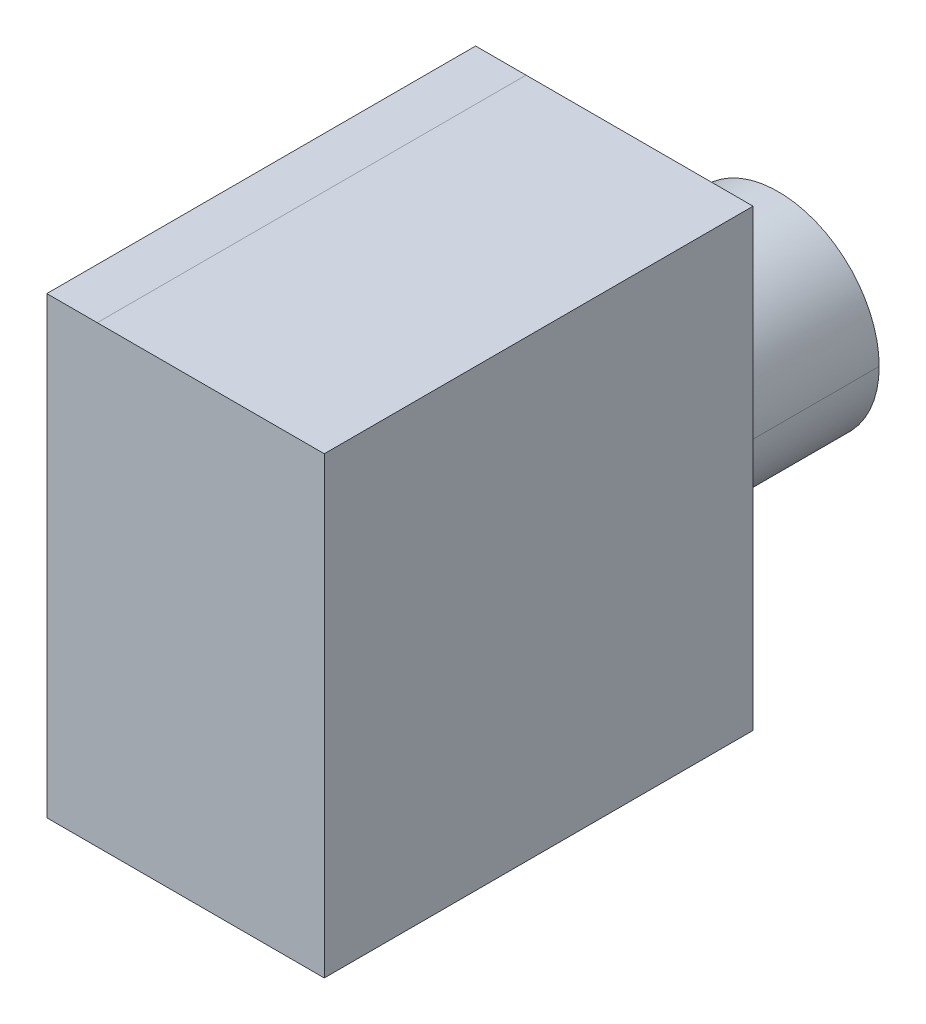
ISO-10303-21;
HEADER;
FILE_DESCRIPTION(('STEP AP214'),'2;1');
FILE_NAME('part.step','',(''),(''),'','','');
FILE_SCHEMA(('AUTOMOTIVE_DESIGN { 1 0 10303 214 1 1 1 1 }'));
ENDSEC;
DATA;
#1=APPLICATION_CONTEXT('core data for automotive mechanical design processes');
#2=APPLICATION_PROTOCOL_DEFINITION('international standard','automotive_design',2000,#1);
#3=PRODUCT_CONTEXT('',#1,'mechanical');
#4=PRODUCT('Part','Part','',(#3));
#5=PRODUCT_RELATED_PRODUCT_CATEGORY('part','',(#4));
#6=PRODUCT_DEFINITION_FORMATION('','',#4);
#7=PRODUCT_DEFINITION_CONTEXT('part definition',#1,'design');
#8=PRODUCT_DEFINITION('design','',#6,#7);
#9=PRODUCT_DEFINITION_SHAPE('','',#8);
#10=(LENGTH_UNIT() NAMED_UNIT(*) SI_UNIT(.MILLI.,.METRE.));
#11=(NAMED_UNIT(*) PLANE_ANGLE_UNIT() SI_UNIT($,.RADIAN.));
#12=(NAMED_UNIT(*) SI_UNIT($,.STERADIAN.) SOLID_ANGLE_UNIT());
#13=UNCERTAINTY_MEASURE_WITH_UNIT(LENGTH_MEASURE(1.E-05),#10,'distance_accuracy_value','');
#14=(GEOMETRIC_REPRESENTATION_CONTEXT(3) GLOBAL_UNCERTAINTY_ASSIGNED_CONTEXT((#13)) GLOBAL_UNIT_ASSIGNED_CONTEXT((#10,
#11,#12)) REPRESENTATION_CONTEXT('',''));
#15=CARTESIAN_POINT('',(0.,0.,0.));
#16=DIRECTION('',(0.,0.,1.));
#17=DIRECTION('',(1.,0.,0.));
#18=AXIS2_PLACEMENT_3D('',#15,#16,#17);
#19=CARTESIAN_POINT('',(0.,5.,-44.0294293));
#20=DIRECTION('',(0.,0.,-1.));
#21=DIRECTION('',(0.,-1.,0.));
#22=AXIS2_PLACEMENT_3D('',#19,#20,#21);
#23=PLANE('',#22);
#24=DIRECTION('',(0.,-1.,0.));
#25=VECTOR('',#24,1.);
#26=CARTESIAN_POINT('',(24.525,14.,-44.0294293));
#27=LINE('',#26,#25);
#28=CARTESIAN_POINT('',(24.525,14.,-44.0294293));
#29=VERTEX_POINT('',#28);
#30=CARTESIAN_POINT('',(24.525,5.,-44.0294293));
#31=VERTEX_POINT('',#30);
#32=EDGE_CURVE('E24',#29,#31,#27,.T.);
#33=ORIENTED_EDGE('',*,*,#32,.T.);
#34=DIRECTION('',(-1.,0.,0.));
#35=VECTOR('',#34,1.);
#36=CARTESIAN_POINT('',(24.525,5.,-44.0294293));
#37=LINE('',#36,#35);
#38=CARTESIAN_POINT('',(19.025,5.,-44.0294293));
#39=VERTEX_POINT('',#38);
#40=EDGE_CURVE('E90',#31,#39,#37,.T.);
#41=ORIENTED_EDGE('',*,*,#40,.T.);
#42=DIRECTION('',(0.,1.,0.));
#43=VECTOR('',#42,1.);
#44=CARTESIAN_POINT('',(19.025,14.,-44.0294293));
#45=LINE('',#44,#43);
#46=CARTESIAN_POINT('',(19.025,14.,-44.0294293));
#47=VERTEX_POINT('',#46);
#48=EDGE_CURVE('E84',#39,#47,#45,.T.);
#49=ORIENTED_EDGE('',*,*,#48,.T.);
#50=DIRECTION('',(1.,0.,0.));
#51=VECTOR('',#50,1.);
#52=CARTESIAN_POINT('',(24.525,14.,-44.0294293));
#53=LINE('',#52,#51);
#54=CARTESIAN_POINT('',(20.025,14.,-44.0294293));
#55=VERTEX_POINT('',#54);
#56=EDGE_CURVE('E88',#47,#55,#53,.T.);
#57=ORIENTED_EDGE('',*,*,#56,.T.);
#58=DIRECTION('',(1.,0.,0.));
#59=VECTOR('',#58,1.);
#60=CARTESIAN_POINT('',(24.525,14.,-44.0294293));
#61=LINE('',#60,#59);
#62=EDGE_CURVE('E111',#55,#29,#61,.T.);
#63=ORIENTED_EDGE('',*,*,#62,.T.);
#64=EDGE_LOOP('',(#33,#41,#49,#57,#63));
#65=FACE_BOUND('',#64,.T.);
#66=CARTESIAN_POINT('',(22.025,9.5,-44.0294293));
#67=DIRECTION('',(0.,0.,-1.));
#68=DIRECTION('',(-1.,0.,0.));
#69=AXIS2_PLACEMENT_3D('',#66,#67,#68);
#70=CIRCLE('',#69,2.);
#71=CARTESIAN_POINT('',(24.025,9.5,-44.0294293));
#72=VERTEX_POINT('',#71);
#73=CARTESIAN_POINT('',(20.025,9.5,-44.0294293));
#74=VERTEX_POINT('',#73);
#75=EDGE_CURVE('E9',#72,#74,#70,.T.);
#76=ORIENTED_EDGE('',*,*,#75,.F.);
#77=CARTESIAN_POINT('',(22.025,9.5,-44.0294293));
#78=DIRECTION('',(0.,0.,-1.));
#79=DIRECTION('',(-1.,0.,0.));
#80=AXIS2_PLACEMENT_3D('',#77,#78,#79);
#81=CIRCLE('',#80,2.);
#82=EDGE_CURVE('E284',#74,#72,#81,.T.);
#83=ORIENTED_EDGE('',*,*,#82,.F.);
#84=EDGE_LOOP('',(#76,#83));
#85=FACE_BOUND('',#84,.T.);
#86=ADVANCED_FACE('F15',(#65,#85),#23,.T.);
#87=CARTESIAN_POINT('',(22.025,9.5,-47.0294293));
#88=DIRECTION('',(0.,0.,1.));
#89=DIRECTION('',(1.,0.,0.));
#90=AXIS2_PLACEMENT_3D('',#87,#88,#89);
#91=CYLINDRICAL_SURFACE('',#90,2.);
#92=DIRECTION('',(0.,0.,1.));
#93=VECTOR('',#92,1.);
#94=CARTESIAN_POINT('',(20.025,9.5,-47.0294293));
#95=LINE('',#94,#93);
#96=CARTESIAN_POINT('',(20.025,9.5,-47.0294293));
#97=VERTEX_POINT('',#96);
#98=EDGE_CURVE('E277',#97,#74,#95,.T.);
#99=ORIENTED_EDGE('',*,*,#98,.F.);
#100=CARTESIAN_POINT('',(22.025,9.5,-47.0294293));
#101=DIRECTION('',(0.,0.,-1.));
#102=DIRECTION('',(-1.,0.,0.));
#103=AXIS2_PLACEMENT_3D('',#100,#101,#102);
#104=CIRCLE('',#103,2.);
#105=CARTESIAN_POINT('',(24.025,9.5,-47.0294293));
#106=VERTEX_POINT('',#105);
#107=EDGE_CURVE('E136',#106,#97,#104,.T.);
#108=ORIENTED_EDGE('',*,*,#107,.F.);
#109=DIRECTION('',(0.,0.,1.));
#110=VECTOR('',#109,1.);
#111=CARTESIAN_POINT('',(24.025,9.5,-47.0294293));
#112=LINE('',#111,#110);
#113=EDGE_CURVE('E121',#106,#72,#112,.T.);
#114=ORIENTED_EDGE('',*,*,#113,.T.);
#115=ORIENTED_EDGE('',*,*,#75,.T.);
#116=EDGE_LOOP('',(#99,#108,#114,#115));
#117=FACE_BOUND('',#116,.T.);
#118=ADVANCED_FACE('F229',(#117),#91,.T.);
#119=CARTESIAN_POINT('',(24.525,14.,-35.5294293));
#120=DIRECTION('',(-1.,0.,0.));
#121=DIRECTION('',(0.,1.,0.));
#122=AXIS2_PLACEMENT_3D('',#119,#120,#121);
#123=PLANE('',#122);
#124=ORIENTED_EDGE('',*,*,#32,.F.);
#125=DIRECTION('',(0.,0.,-1.));
#126=VECTOR('',#125,1.);
#127=CARTESIAN_POINT('',(24.525,14.,-35.5294293));
#128=LINE('',#127,#126);
#129=CARTESIAN_POINT('',(24.525,14.,-35.5294293));
#130=VERTEX_POINT('',#129);
#131=EDGE_CURVE('E117',#130,#29,#128,.T.);
#132=ORIENTED_EDGE('',*,*,#131,.F.);
#133=DIRECTION('',(0.,1.,0.));
#134=VECTOR('',#133,1.);
#135=CARTESIAN_POINT('',(24.525,14.,-35.5294293));
#136=LINE('',#135,#134);
#137=CARTESIAN_POINT('',(24.525,5.,-35.5294293));
#138=VERTEX_POINT('',#137);
#139=EDGE_CURVE('E130',#138,#130,#136,.T.);
#140=ORIENTED_EDGE('',*,*,#139,.F.);
#141=DIRECTION('',(0.,0.,-1.));
#142=VECTOR('',#141,1.);
#143=CARTESIAN_POINT('',(24.525,5.,-35.5294293));
#144=LINE('',#143,#142);
#145=EDGE_CURVE('E94',#138,#31,#144,.T.);
#146=ORIENTED_EDGE('',*,*,#145,.T.);
#147=EDGE_LOOP('',(#124,#132,#140,#146));
#148=FACE_BOUND('',#147,.T.);
#149=ADVANCED_FACE('F219',(#148),#123,.F.);
#150=CARTESIAN_POINT('',(0.,5.,-3.));
#151=DIRECTION('',(0.,1.,0.));
#152=DIRECTION('',(1.,0.,0.));
#153=AXIS2_PLACEMENT_3D('',#150,#151,#152);
#154=PLANE('',#153);
#155=ORIENTED_EDGE('',*,*,#145,.F.);
#156=DIRECTION('',(-1.,0.,0.));
#157=VECTOR('',#156,1.);
#158=CARTESIAN_POINT('',(0.,5.,-35.5294293));
#159=LINE('',#158,#157);
#160=CARTESIAN_POINT('',(19.025,5.,-35.5294293));
#161=VERTEX_POINT('',#160);
#162=EDGE_CURVE('E126',#138,#161,#159,.T.);
#163=ORIENTED_EDGE('',*,*,#162,.T.);
#164=DIRECTION('',(0.,0.,1.));
#165=VECTOR('',#164,1.);
#166=CARTESIAN_POINT('',(19.025,5.,-44.5294293));
#167=LINE('',#166,#165);
#168=EDGE_CURVE('E95',#39,#161,#167,.T.);
#169=ORIENTED_EDGE('',*,*,#168,.F.);
#170=ORIENTED_EDGE('',*,*,#40,.F.);
#171=EDGE_LOOP('',(#155,#163,#169,#170));
#172=FACE_BOUND('',#171,.T.);
#173=ADVANCED_FACE('F210',(#172),#154,.F.);
#174=CARTESIAN_POINT('',(19.025,14.,-44.5294293));
#175=DIRECTION('',(1.,0.,0.));
#176=DIRECTION('',(0.,-1.,0.));
#177=AXIS2_PLACEMENT_3D('',#174,#175,#176);
#178=PLANE('',#177);
#179=ORIENTED_EDGE('',*,*,#168,.T.);
#180=DIRECTION('',(0.,1.,0.));
#181=VECTOR('',#180,1.);
#182=CARTESIAN_POINT('',(19.025,14.,-35.5294293));
#183=LINE('',#182,#181);
#184=CARTESIAN_POINT('',(19.025,14.,-35.5294293));
#185=VERTEX_POINT('',#184);
#186=EDGE_CURVE('E101',#161,#185,#183,.T.);
#187=ORIENTED_EDGE('',*,*,#186,.T.);
#188=DIRECTION('',(0.,0.,1.));
#189=VECTOR('',#188,1.);
#190=CARTESIAN_POINT('',(19.025,14.,-44.5294293));
#191=LINE('',#190,#189);
#192=EDGE_CURVE('E98',#47,#185,#191,.T.);
#193=ORIENTED_EDGE('',*,*,#192,.F.);
#194=ORIENTED_EDGE('',*,*,#48,.F.);
#195=EDGE_LOOP('',(#179,#187,#193,#194));
#196=FACE_BOUND('',#195,.T.);
#197=ADVANCED_FACE('F99',(#196),#178,.F.);
#198=CARTESIAN_POINT('',(-8.,14.,-7.));
#199=DIRECTION('',(0.,1.,0.));
#200=DIRECTION('',(1.,0.,0.));
#201=AXIS2_PLACEMENT_3D('',#198,#199,#200);
#202=PLANE('',#201);
#203=DIRECTION('',(-1.,0.,0.));
#204=VECTOR('',#203,1.);
#205=CARTESIAN_POINT('',(47.025,14.,-35.5294293));
#206=LINE('',#205,#204);
#207=CARTESIAN_POINT('',(20.025,14.,-35.5294293));
#208=VERTEX_POINT('',#207);
#209=EDGE_CURVE('E123',#208,#185,#206,.T.);
#210=ORIENTED_EDGE('',*,*,#209,.F.);
#211=DIRECTION('',(0.,0.,-1.));
#212=VECTOR('',#211,1.);
#213=CARTESIAN_POINT('',(20.025,14.,-7.));
#214=LINE('',#213,#212);
#215=EDGE_CURVE('E109',#208,#55,#214,.T.);
#216=ORIENTED_EDGE('',*,*,#215,.T.);
#217=ORIENTED_EDGE('',*,*,#56,.F.);
#218=ORIENTED_EDGE('',*,*,#192,.T.);
#219=EDGE_LOOP('',(#210,#216,#217,#218));
#220=FACE_BOUND('',#219,.T.);
#221=ADVANCED_FACE('F108',(#220),#202,.T.);
#222=CARTESIAN_POINT('',(-8.,14.,-7.));
#223=DIRECTION('',(0.,1.,0.));
#224=DIRECTION('',(1.,0.,0.));
#225=AXIS2_PLACEMENT_3D('',#222,#223,#224);
#226=PLANE('',#225);
#227=ORIENTED_EDGE('',*,*,#215,.F.);
#228=DIRECTION('',(-1.,0.,0.));
#229=VECTOR('',#228,1.);
#230=CARTESIAN_POINT('',(47.025,14.,-35.5294293));
#231=LINE('',#230,#229);
#232=EDGE_CURVE('E125',#130,#208,#231,.T.);
#233=ORIENTED_EDGE('',*,*,#232,.F.);
#234=ORIENTED_EDGE('',*,*,#131,.T.);
#235=ORIENTED_EDGE('',*,*,#62,.F.);
#236=EDGE_LOOP('',(#227,#233,#234,#235));
#237=FACE_BOUND('',#236,.T.);
#238=ADVANCED_FACE('F157',(#237),#226,.T.);
#239=CARTESIAN_POINT('',(22.025,9.5,-47.0294293));
#240=DIRECTION('',(0.,0.,-1.));
#241=DIRECTION('',(-1.,0.,0.));
#242=AXIS2_PLACEMENT_3D('',#239,#240,#241);
#243=PLANE('',#242);
#244=ORIENTED_EDGE('',*,*,#107,.T.);
#245=CARTESIAN_POINT('',(22.025,9.5,-47.0294293));
#246=DIRECTION('',(0.,0.,-1.));
#247=DIRECTION('',(-1.,0.,0.));
#248=AXIS2_PLACEMENT_3D('',#245,#246,#247);
#249=CIRCLE('',#248,2.);
#250=EDGE_CURVE('E285',#97,#106,#249,.T.);
#251=ORIENTED_EDGE('',*,*,#250,.T.);
#252=EDGE_LOOP('',(#244,#251));
#253=FACE_BOUND('',#252,.T.);
#254=ADVANCED_FACE('F162',(#253),#243,.T.);
#255=CARTESIAN_POINT('',(55.035,17.532500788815,-35.5294293));
#256=DIRECTION('',(0.,0.,-1.));
#257=DIRECTION('',(-1.,0.,0.));
#258=AXIS2_PLACEMENT_3D('',#255,#256,#257);
#259=PLANE('',#258);
#260=ORIENTED_EDGE('',*,*,#162,.F.);
#261=ORIENTED_EDGE('',*,*,#139,.T.);
#262=ORIENTED_EDGE('',*,*,#232,.T.);
#263=ORIENTED_EDGE('',*,*,#209,.T.);
#264=ORIENTED_EDGE('',*,*,#186,.F.);
#265=EDGE_LOOP('',(#260,#261,#262,#263,#264));
#266=FACE_BOUND('',#265,.T.);
#267=ADVANCED_FACE('F176',(#266),#259,.F.);
#268=CARTESIAN_POINT('',(22.025,9.5,-47.0294293));
#269=DIRECTION('',(0.,0.,1.));
#270=DIRECTION('',(1.,0.,0.));
#271=AXIS2_PLACEMENT_3D('',#268,#269,#270);
#272=CYLINDRICAL_SURFACE('',#271,2.);
#273=ORIENTED_EDGE('',*,*,#250,.F.);
#274=ORIENTED_EDGE('',*,*,#98,.T.);
#275=ORIENTED_EDGE('',*,*,#82,.T.);
#276=ORIENTED_EDGE('',*,*,#113,.F.);
#277=EDGE_LOOP('',(#273,#274,#275,#276));
#278=FACE_BOUND('',#277,.T.);
#279=ADVANCED_FACE('F171',(#278),#272,.T.);
#280=CLOSED_SHELL('',(#86,#118,#149,#173,#197,#221,#238,#254,#267,#279));
#281=MANIFOLD_SOLID_BREP('B1',#280);
#282=ADVANCED_BREP_SHAPE_REPRESENTATION('',(#18,#281),#14);
#283=SHAPE_DEFINITION_REPRESENTATION(#9,#282);
ENDSEC;
END-ISO-10303-21;
